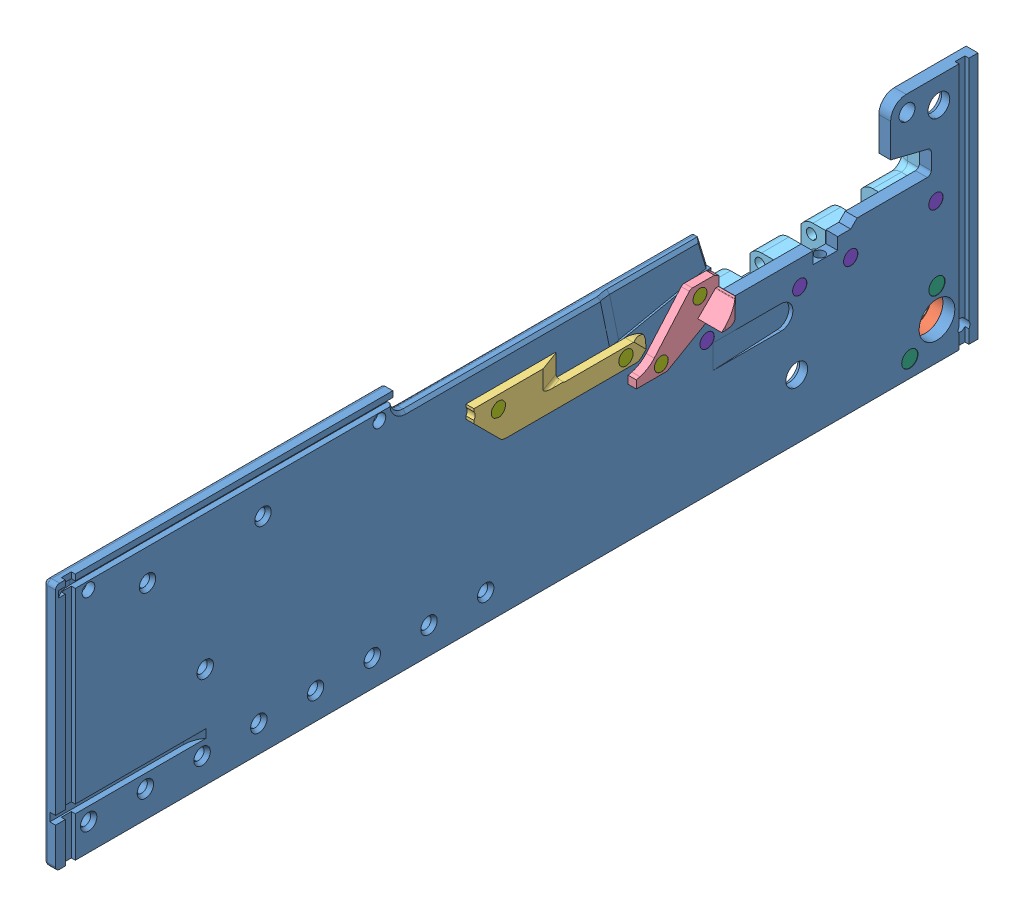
SolidWorks assembly left plate.SLDASM, configuration По умолчанию (file format 6000). Lengths in mm.
Overall size (27.23 98.78 367.67).
15 component instances, 8 part files, 35 mates.
Components (placement in the parent):
- left plate-1: left plate.SLDPRT [По умолчанию] at origin size (4.72 98.78 367.64)
- left plate adapter mount-1: left plate adapter mount.SLDPRT [По умолчанию] at (0 -8.89 -55.88) x (0 0 1) z (-1 0 0) size (32.77 31.27 5.54)
- left plate extractor feed cam-1: left plate extractor feed cam.SLDPRT [По умолчанию] at (4.7244 50.7492 122.0724) size (3.2 16.54 70.31)
- left plate extractor cam-1: left plate extractor cam.SLDPRT [По умолчанию] at (4.7244 49.6062 41.7576) size (12.73 23.7 33.02)
- left plate belt holding-1: left plate belt holding.SLDPRT [По умолчанию] at (-9.652 29.718 35.7124) size (9.78 26.57 104.01)
- left plate adapter mount rivet-1: left plate adapter mount rivet.SLDPRT [По умолчанию] at (4.6228 -17.018 -45.085) size (10.16 6.5 6.5)
- left plate adapter mount rivet-2: left plate adapter mount rivet.SLDPRT [По умолчанию] at (4.6228 2.7686 -55.88) size (10.16 6.5 6.5)
- left plate extractor rivet-1: left plate extractor rivet.SLDPRT [По умолчанию] at (7.9248 49.6062 41.7576) x (1 0 0) z (0 0.673321 -0.739351) size (8.61 5.76 5.76)
- left plate extractor rivet-2: left plate extractor rivet.SLDPRT [По умолчанию] at (7.9248 33.9852 57.2008) x (1 0 0) z (0 0.97924 0.202704) size (8.61 5.76 5.76)
- left plate extractor rivet-3: left plate extractor rivet.SLDPRT [По умолчанию] at (7.9248 50.7492 122.0724) x (1 0 0) z (0 0.86176 -0.507316) size (8.61 5.76 5.76)
- left plate extractor rivet-4: left plate extractor rivet.SLDPRT [По умолчанию] at (7.9248 43.1292 71.2724) x (1 0 0) z (0 0.739244 -0.673438) size (8.61 5.76 5.76)
- left plate belt holding rivet-1: left plate belt holding rivet.SLDPRT [По умолчанию] at (4.6736 29.718 -1.1938) size (14.33 5.76 5.76)
- left plate belt holding rivet-2: left plate belt holding rivet.SLDPRT [По умолчанию] at (4.6736 29.718 -21.5138) size (14.33 5.76 5.76)
- left plate belt holding rivet-3: left plate belt holding rivet.SLDPRT [По умолчанию] at (4.6736 32.258 -55.4482) size (14.33 5.76 5.76)
- left plate belt holding rivet-4: left plate belt holding rivet.SLDPRT [По умолчанию] at (4.6736 29.718 35.7124) size (14.33 5.76 5.76)
Mates (geometry in assembly coordinates):
- Совпадение1: coincident anti-aligned: plane of left plate-1 through (0 68.7832 -43.6118) normal (-1 0 0); plane of left plate adapter mount-1 through (0 -8.9154 -55.88) normal (1 0 0)
- Концентричный1: concentric anti-aligned: cylinder of left plate-1 through (4.7244 -17.018 -66.675) axis (-1 0 0) radius 2.3685; cylinder of left plate adapter mount-1 through (-5.5372 -17.018 -66.675) axis (1 0 0) radius 2.3685
- Концентричный11: concentric anti-aligned: cylinder of left plate-1 through (4.7244 2.7686 -55.88) axis (-1 0 0) radius 2.3685; cylinder of left plate adapter mount-1 through (-5.5372 2.7686 -55.88) axis (1 0 0) radius 2.3685
- Совпадение3: coincident anti-aligned: plane of left plate-1 through (4.7244 68.7832 -43.6118) normal (1 0 0); plane of left plate extractor feed cam-1 through (4.7244 34.671 68.326) normal (-1 0 0)
- Концентричный15: concentric aligned: cylinder of left plate-1 through (4.7244 50.7492 122.0724) axis (-1 0 0) radius 1.9812; cylinder of left plate extractor feed cam-1 through (7.9248 50.7492 122.0724) axis (-1 0 0) radius 1.9812
- Концентричный16: concentric aligned: cylinder of left plate-1 through (4.7244 43.1292 71.2724) axis (-1 0 0) radius 1.9812; cylinder of left plate extractor feed cam-1 through (7.9248 43.1292 71.2724) axis (-1 0 0) radius 1.9812
- Совпадение4: coincident anti-aligned: plane of left plate-1 through (4.7244 68.7832 -43.6118) normal (1 0 0); plane of left plate extractor cam-1 through (4.7244 44.9238 68.6971) normal (-1 0 0)
- Концентричный17: concentric aligned: cylinder of left plate-1 through (4.7244 33.9852 57.2008) axis (-1 0 0) radius 1.9812; cylinder of left plate extractor cam-1 through (7.9502 33.9852 57.2008) axis (-1 0 0) radius 1.9685
- Концентричный18: concentric aligned: cylinder of left plate-1 through (4.7244 49.6062 41.7576) axis (-1 0 0) radius 1.9812; cylinder of left plate extractor cam-1 through (7.9502 49.6062 41.7576) axis (-1 0 0) radius 1.9685
- Совпадение5: coincident anti-aligned: plane of left plate-1 through (0 68.7832 -43.6118) normal (-1 0 0); plane of left plate belt holding-1 through (0 46.8539 41.3449) normal (1 0 0)
- Концентричный19: concentric aligned: cylinder of left plate-1 through (4.7244 32.258 -55.4482) axis (-1 0 0) radius 1.9812; cylinder of left plate belt holding-1 through (0 32.258 -55.4482) axis (-1 0 0) radius 1.9685
- Концентричный20: concentric aligned: cylinder of left plate-1 through (4.7244 29.718 35.7124) axis (-1 0 0) radius 1.9812; cylinder of left plate belt holding-1 through (0 29.718 35.7124) axis (-1 0 0) radius 1.9685
- Концентричный21: concentric aligned: cylinder of left plate adapter mount-1 through (-5.5372 2.7686 -55.88) axis (1 0 0) radius 2.3685; cylinder of left plate adapter mount rivet-2 through (4.6228 2.7686 -55.88) axis (1 0 0) radius 2.3685
- Концентричный22: concentric aligned: cylinder of left plate adapter mount-1 through (-5.5372 -17.018 -45.085) axis (1 0 0) radius 2.3685; cylinder of left plate adapter mount rivet-1 through (4.6228 -17.018 -45.085) axis (1 0 0) radius 2.3685
- Совпадение7: coincident anti-aligned: circle of left plate adapter mount-1; circle of left plate adapter mount rivet-1
- Совпадение9: coincident anti-aligned: circle of left plate adapter mount-1; circle of left plate adapter mount rivet-2
- Концентричный23: concentric anti-aligned: cylinder of left plate extractor feed cam-1 through (7.9248 50.7492 122.0724) axis (-1 0 0) radius 1.9812; cylinder of left plate extractor rivet-3 through (7.9248 50.7492 122.0724) axis (1 0 0) radius 1.9685
- Концентричный24: concentric anti-aligned: circle of left plate-1; circle of left plate extractor rivet-3
- Концентричный25: concentric anti-aligned: circle of left plate-1; circle of left plate extractor rivet-3
- Концентричный26: concentric anti-aligned: cone of left plate-1 through (0 50.7492 122.0724) axis (1 0 0); cone of left plate extractor rivet-3 through (7.9248 50.7492 122.0724) axis (-1 0 0)
- Концентричный27: concentric anti-aligned: cylinder of left plate extractor feed cam-1 through (7.9248 43.1292 71.2724) axis (-1 0 0) radius 1.9812; cylinder of left plate extractor rivet-4 through (-41.5775 43.1292 71.2724) axis (-1 0 0) radius 1.9685
- Концентричный28: concentric anti-aligned: cylinder of left plate extractor cam-1 through (7.9502 49.6062 41.7576) axis (-1 0 0) radius 1.9685; cylinder of left plate extractor rivet-1 through (-40.4105 49.6062 41.7576) axis (-1 0 0) radius 1.9685
- Концентричный29: concentric anti-aligned: cylinder of left plate extractor cam-1 through (7.9502 33.9852 57.2008) axis (-1 0 0) radius 1.9685; cylinder of left plate extractor rivet-2 through (7.9248 33.9852 57.2008) axis (1 0 0) radius 1.9685
- Концентричный30: concentric anti-aligned: cylinder of left plate-1 through (4.7244 29.718 35.7124) axis (-1 0 0) radius 1.9812; cylinder of left plate belt holding rivet-4 through (4.6736 29.718 35.7124) axis (1 0 0) radius 1.9685
- Совпадение14: coincident aligned: plane of left plate belt holding-1 through (-9.652 46.8539 41.3449) normal (-1 0 0); plane of left plate belt holding rivet-4 through (-9.652 32.5957 35.7124) normal (-1 0 0)
- Концентричный31: concentric anti-aligned: cylinder of left plate belt holding-1 through (0 29.718 -1.1938) axis (-1 0 0) radius 1.9685; cylinder of left plate belt holding rivet-1 through (4.6736 29.718 -1.1938) axis (1 0 0) radius 1.9685
- Совпадение15: coincident aligned: plane of left plate belt holding-1 through (-9.652 46.8539 41.3449) normal (-1 0 0); plane of left plate belt holding rivet-1 through (-9.652 32.5957 -1.1938) normal (-1 0 0)
- Концентричный32: concentric anti-aligned: cylinder of left plate belt holding-1 through (0 29.718 -21.5138) axis (-1 0 0) radius 1.9685; cylinder of left plate belt holding rivet-2 through (4.6736 29.718 -21.5138) axis (1 0 0) radius 1.9685
- Совпадение16: coincident aligned: plane of left plate belt holding-1 through (-9.652 46.8539 41.3449) normal (-1 0 0); plane of left plate belt holding rivet-2 through (-9.652 32.5957 -21.5138) normal (-1 0 0)
- Концентричный33: concentric anti-aligned: cylinder of left plate belt holding-1 through (0 32.258 -55.4482) axis (-1 0 0) radius 1.9685; cylinder of left plate belt holding rivet-3 through (4.6736 32.258 -55.4482) axis (1 0 0) radius 1.9685
- Совпадение17: coincident aligned: plane of left plate belt holding-1 through (-9.652 46.8539 41.3449) normal (-1 0 0); plane of left plate belt holding rivet-3 through (-9.652 35.1357 -55.4482) normal (-1 0 0)
- Совпадение18: coincident anti-aligned: plane of left plate-1 through (0 68.7832 -43.6118) normal (-1 0 0); circle of left plate extractor rivet-3
- Совпадение19: coincident anti-aligned: plane of left plate-1 through (0 68.7832 -43.6118) normal (-1 0 0); circle of left plate extractor rivet-4
- Совпадение20: coincident anti-aligned: plane of left plate-1 through (0 68.7832 -43.6118) normal (-1 0 0); circle of left plate extractor rivet-2
- Совпадение21: coincident anti-aligned: plane of left plate-1 through (0 68.7832 -43.6118) normal (-1 0 0); circle of left plate extractor rivet-1
